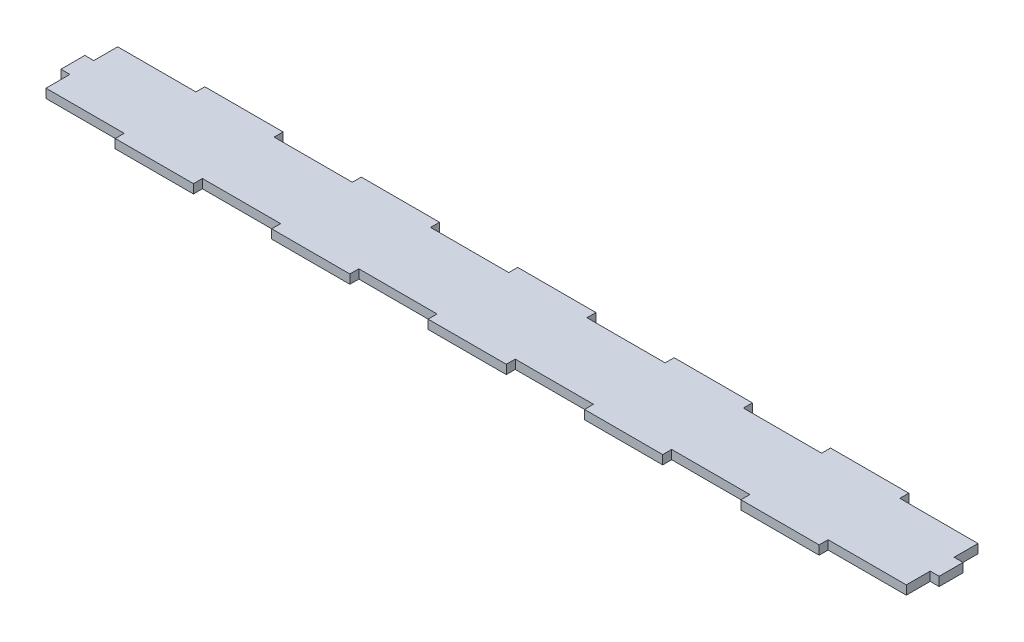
from build123d import *

# Parameters (mm, degrees)
BOSS_EXTRUDE1_DEPTH = 3.175


with BuildPart() as part:
    # Sketch2 → Boss-Extrude1 (new body)
    with BuildSketch(Plane(origin=(0, 0, 0), x_dir=(1, 0, 0), z_dir=(0, 1, 0))):
        Polygon((-180.109090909, 25.4), (-152.4, 25.4), (-152.4, 28.575), (-124.690909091, 28.575), (-124.690909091, 25.4), (-96.981818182, 25.4), (-96.981818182, 28.575), (-69.272727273, 28.575), (-69.272727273, 25.4), (-41.563636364, 25.4), (-41.563636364, 28.575), (-13.854545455, 28.575), (-13.854545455, 25.4), (13.854545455, 25.4), (13.854545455, 28.575), (41.563636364, 28.575), (41.563636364, 25.4), (69.272727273, 25.4), (69.272727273, 28.575), (96.981818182, 28.575), (96.981818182, 25.4), (124.690909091, 25.4), (124.690909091, 16.933333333), (127.865909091, 16.933333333), (127.865909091, 8.466666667), (124.690909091, 8.466666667), (124.690909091, 0), (96.981818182, 0), (96.981818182, -3.175), (69.272727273, -3.175), (69.272727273, 0), (41.563636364, 0), (41.563636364, -3.175), (13.854545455, -3.175), (13.854545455, 0), (-13.854545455, 0), (-13.854545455, -3.175), (-41.563636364, -3.175), (-41.563636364, 0), (-69.272727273, 0), (-69.272727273, -3.175), (-96.981818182, -3.175), (-96.981818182, 0), (-124.690909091, 0), (-124.690909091, -3.175), (-152.4, -3.175), (-152.4, 0), (-180.109090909, 0), (-180.109090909, 8.466666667), (-183.284090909, 8.466666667), (-183.284090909, 16.933333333), (-180.109090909, 16.933333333), align=None)
    extrude(amount=BOSS_EXTRUDE1_DEPTH)


solid = part.part
